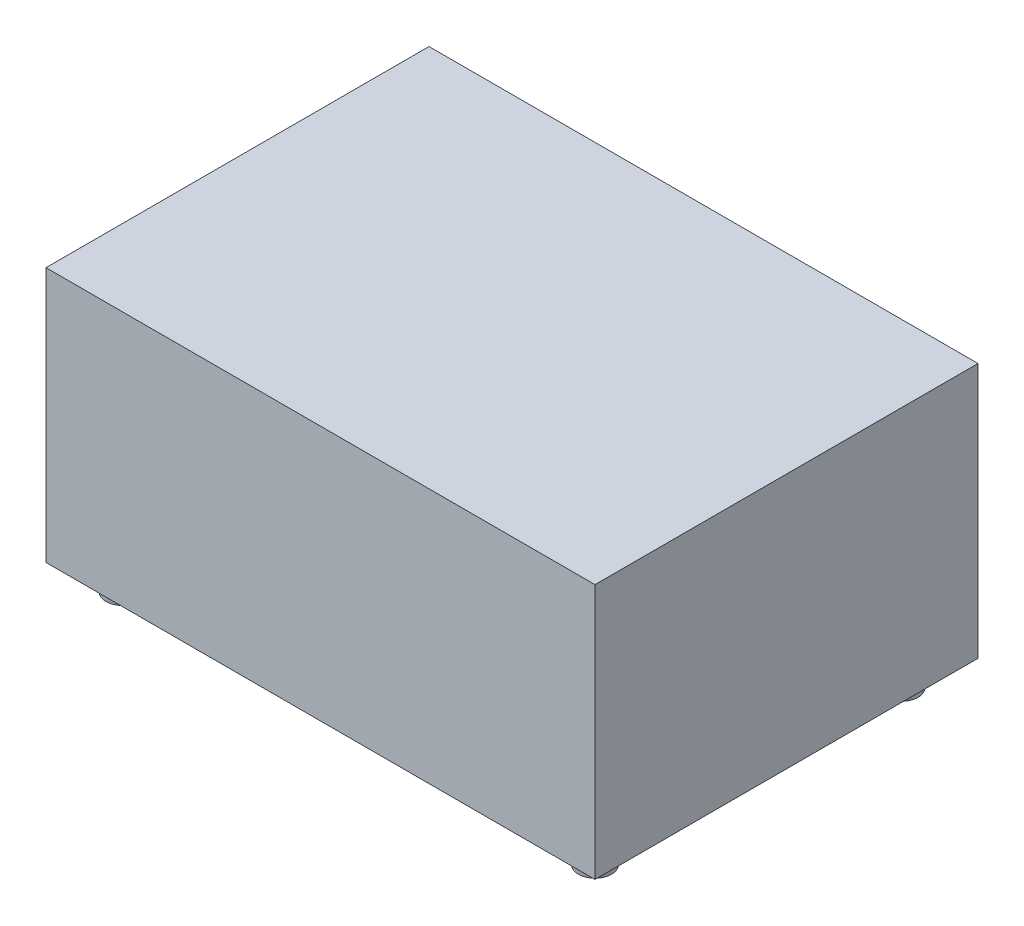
ISO-10303-21;
HEADER;
FILE_DESCRIPTION(('STEP AP214'),'2;1');
FILE_NAME('part.step','',(''),(''),'','','');
FILE_SCHEMA(('AUTOMOTIVE_DESIGN { 1 0 10303 214 1 1 1 1 }'));
ENDSEC;
DATA;
#1=APPLICATION_CONTEXT('core data for automotive mechanical design processes');
#2=APPLICATION_PROTOCOL_DEFINITION('international standard','automotive_design',2000,#1);
#3=PRODUCT_CONTEXT('',#1,'mechanical');
#4=PRODUCT('Part','Part','',(#3));
#5=PRODUCT_RELATED_PRODUCT_CATEGORY('part','',(#4));
#6=PRODUCT_DEFINITION_FORMATION('','',#4);
#7=PRODUCT_DEFINITION_CONTEXT('part definition',#1,'design');
#8=PRODUCT_DEFINITION('design','',#6,#7);
#9=PRODUCT_DEFINITION_SHAPE('','',#8);
#10=(LENGTH_UNIT() NAMED_UNIT(*) SI_UNIT(.MILLI.,.METRE.));
#11=(NAMED_UNIT(*) PLANE_ANGLE_UNIT() SI_UNIT($,.RADIAN.));
#12=(NAMED_UNIT(*) SI_UNIT($,.STERADIAN.) SOLID_ANGLE_UNIT());
#13=UNCERTAINTY_MEASURE_WITH_UNIT(LENGTH_MEASURE(1.E-05),#10,'distance_accuracy_value','');
#14=(GEOMETRIC_REPRESENTATION_CONTEXT(3) GLOBAL_UNCERTAINTY_ASSIGNED_CONTEXT((#13)) GLOBAL_UNIT_ASSIGNED_CONTEXT((#10,
#11,#12)) REPRESENTATION_CONTEXT('',''));
#15=CARTESIAN_POINT('',(0.,0.,0.));
#16=DIRECTION('',(0.,0.,1.));
#17=DIRECTION('',(1.,0.,0.));
#18=AXIS2_PLACEMENT_3D('',#15,#16,#17);
#19=CARTESIAN_POINT('',(0.,-100.,150.));
#20=DIRECTION('',(0.,1.,0.));
#21=DIRECTION('',(0.,0.,1.));
#22=AXIS2_PLACEMENT_3D('',#19,#20,#21);
#23=PLANE('',#22);
#24=CARTESIAN_POINT('',(200.,-100.,15.));
#25=DIRECTION('',(0.,1.,0.));
#26=DIRECTION('',(0.,0.,1.));
#27=AXIS2_PLACEMENT_3D('',#24,#25,#26);
#28=CIRCLE('',#27,7.50000000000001);
#29=CARTESIAN_POINT('',(200.,-100.,22.5));
#30=VERTEX_POINT('',#29);
#31=EDGE_CURVE('E116',#30,#30,#28,.F.);
#32=ORIENTED_EDGE('',*,*,#31,.F.);
#33=EDGE_LOOP('',(#32));
#34=FACE_BOUND('',#33,.T.);
#35=CARTESIAN_POINT('',(15.,-100.,15.));
#36=DIRECTION('',(0.,1.,0.));
#37=DIRECTION('',(0.,0.,1.));
#38=AXIS2_PLACEMENT_3D('',#35,#36,#37);
#39=CIRCLE('',#38,7.5);
#40=CARTESIAN_POINT('',(15.,-100.,22.5));
#41=VERTEX_POINT('',#40);
#42=EDGE_CURVE('E110',#41,#41,#39,.F.);
#43=ORIENTED_EDGE('',*,*,#42,.F.);
#44=EDGE_LOOP('',(#43));
#45=FACE_BOUND('',#44,.T.);
#46=DIRECTION('',(1.,0.,0.));
#47=VECTOR('',#46,1.);
#48=CARTESIAN_POINT('',(0.,-100.,0.));
#49=LINE('',#48,#47);
#50=CARTESIAN_POINT('',(0.,-100.,0.));
#51=VERTEX_POINT('',#50);
#52=CARTESIAN_POINT('',(215.,-100.,0.));
#53=VERTEX_POINT('',#52);
#54=EDGE_CURVE('E91',#51,#53,#49,.T.);
#55=ORIENTED_EDGE('',*,*,#54,.T.);
#56=DIRECTION('',(0.,0.,-1.));
#57=VECTOR('',#56,1.);
#58=CARTESIAN_POINT('',(215.,-100.,150.));
#59=LINE('',#58,#57);
#60=CARTESIAN_POINT('',(215.,-100.,150.));
#61=VERTEX_POINT('',#60);
#62=EDGE_CURVE('E89',#61,#53,#59,.T.);
#63=ORIENTED_EDGE('',*,*,#62,.F.);
#64=DIRECTION('',(1.,0.,0.));
#65=VECTOR('',#64,1.);
#66=CARTESIAN_POINT('',(0.,-100.,150.));
#67=LINE('',#66,#65);
#68=CARTESIAN_POINT('',(0.,-100.,150.));
#69=VERTEX_POINT('',#68);
#70=EDGE_CURVE('E81',#69,#61,#67,.T.);
#71=ORIENTED_EDGE('',*,*,#70,.F.);
#72=DIRECTION('',(0.,0.,-1.));
#73=VECTOR('',#72,1.);
#74=CARTESIAN_POINT('',(0.,-100.,150.));
#75=LINE('',#74,#73);
#76=EDGE_CURVE('E92',#69,#51,#75,.T.);
#77=ORIENTED_EDGE('',*,*,#76,.T.);
#78=EDGE_LOOP('',(#55,#63,#71,#77));
#79=FACE_BOUND('',#78,.T.);
#80=CARTESIAN_POINT('',(15.,-100.,135.));
#81=DIRECTION('',(0.,1.,0.));
#82=DIRECTION('',(0.,0.,1.));
#83=AXIS2_PLACEMENT_3D('',#80,#81,#82);
#84=CIRCLE('',#83,7.5);
#85=CARTESIAN_POINT('',(15.,-100.,142.5));
#86=VERTEX_POINT('',#85);
#87=EDGE_CURVE('E113',#86,#86,#84,.F.);
#88=ORIENTED_EDGE('',*,*,#87,.F.);
#89=EDGE_LOOP('',(#88));
#90=FACE_BOUND('',#89,.T.);
#91=CARTESIAN_POINT('',(200.,-100.,135.));
#92=DIRECTION('',(0.,1.,0.));
#93=DIRECTION('',(0.,0.,1.));
#94=AXIS2_PLACEMENT_3D('',#91,#92,#93);
#95=CIRCLE('',#94,7.50000000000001);
#96=CARTESIAN_POINT('',(200.,-100.,142.5));
#97=VERTEX_POINT('',#96);
#98=EDGE_CURVE('E119',#97,#97,#95,.F.);
#99=ORIENTED_EDGE('',*,*,#98,.F.);
#100=EDGE_LOOP('',(#99));
#101=FACE_BOUND('',#100,.T.);
#102=ADVANCED_FACE('F33',(#34,#45,#79,#90,#101),#23,.F.);
#103=CARTESIAN_POINT('',(0.,0.,150.));
#104=DIRECTION('',(1.,0.,0.));
#105=DIRECTION('',(0.,1.,0.));
#106=AXIS2_PLACEMENT_3D('',#103,#104,#105);
#107=PLANE('',#106);
#108=DIRECTION('',(0.,-1.,0.));
#109=VECTOR('',#108,1.);
#110=CARTESIAN_POINT('',(0.,0.,0.));
#111=LINE('',#110,#109);
#112=CARTESIAN_POINT('',(0.,0.,0.));
#113=VERTEX_POINT('',#112);
#114=EDGE_CURVE('E101',#113,#51,#111,.T.);
#115=ORIENTED_EDGE('',*,*,#114,.T.);
#116=ORIENTED_EDGE('',*,*,#76,.F.);
#117=DIRECTION('',(0.,-1.,0.));
#118=VECTOR('',#117,1.);
#119=CARTESIAN_POINT('',(0.,0.,150.));
#120=LINE('',#119,#118);
#121=CARTESIAN_POINT('',(0.,0.,150.));
#122=VERTEX_POINT('',#121);
#123=EDGE_CURVE('E86',#122,#69,#120,.T.);
#124=ORIENTED_EDGE('',*,*,#123,.F.);
#125=DIRECTION('',(0.,0.,-1.));
#126=VECTOR('',#125,1.);
#127=CARTESIAN_POINT('',(0.,0.,150.));
#128=LINE('',#127,#126);
#129=EDGE_CURVE('E97',#122,#113,#128,.T.);
#130=ORIENTED_EDGE('',*,*,#129,.T.);
#131=EDGE_LOOP('',(#115,#116,#124,#130));
#132=FACE_BOUND('',#131,.T.);
#133=ADVANCED_FACE('F145',(#132),#107,.F.);
#134=CARTESIAN_POINT('',(215.,0.,150.));
#135=DIRECTION('',(-1.,0.,0.));
#136=DIRECTION('',(0.,0.,1.));
#137=AXIS2_PLACEMENT_3D('',#134,#135,#136);
#138=PLANE('',#137);
#139=DIRECTION('',(0.,1.,0.));
#140=VECTOR('',#139,1.);
#141=CARTESIAN_POINT('',(215.,0.,0.));
#142=LINE('',#141,#140);
#143=CARTESIAN_POINT('',(215.,0.,0.));
#144=VERTEX_POINT('',#143);
#145=EDGE_CURVE('E67',#53,#144,#142,.T.);
#146=ORIENTED_EDGE('',*,*,#145,.T.);
#147=DIRECTION('',(0.,0.,-1.));
#148=VECTOR('',#147,1.);
#149=CARTESIAN_POINT('',(215.,0.,150.));
#150=LINE('',#149,#148);
#151=CARTESIAN_POINT('',(215.,0.,150.));
#152=VERTEX_POINT('',#151);
#153=EDGE_CURVE('E93',#152,#144,#150,.T.);
#154=ORIENTED_EDGE('',*,*,#153,.F.);
#155=DIRECTION('',(0.,1.,0.));
#156=VECTOR('',#155,1.);
#157=CARTESIAN_POINT('',(215.,0.,150.));
#158=LINE('',#157,#156);
#159=EDGE_CURVE('E84',#61,#152,#158,.T.);
#160=ORIENTED_EDGE('',*,*,#159,.F.);
#161=ORIENTED_EDGE('',*,*,#62,.T.);
#162=EDGE_LOOP('',(#146,#154,#160,#161));
#163=FACE_BOUND('',#162,.T.);
#164=ADVANCED_FACE('F95',(#163),#138,.F.);
#165=CARTESIAN_POINT('',(0.,0.,150.));
#166=DIRECTION('',(0.,-1.,0.));
#167=DIRECTION('',(0.,0.,-1.));
#168=AXIS2_PLACEMENT_3D('',#165,#166,#167);
#169=PLANE('',#168);
#170=DIRECTION('',(-1.,0.,0.));
#171=VECTOR('',#170,1.);
#172=CARTESIAN_POINT('',(0.,0.,0.));
#173=LINE('',#172,#171);
#174=EDGE_CURVE('E73',#144,#113,#173,.T.);
#175=ORIENTED_EDGE('',*,*,#174,.T.);
#176=ORIENTED_EDGE('',*,*,#129,.F.);
#177=DIRECTION('',(-1.,0.,0.));
#178=VECTOR('',#177,1.);
#179=CARTESIAN_POINT('',(0.,0.,150.));
#180=LINE('',#179,#178);
#181=EDGE_CURVE('E50',#152,#122,#180,.T.);
#182=ORIENTED_EDGE('',*,*,#181,.F.);
#183=ORIENTED_EDGE('',*,*,#153,.T.);
#184=EDGE_LOOP('',(#175,#176,#182,#183));
#185=FACE_BOUND('',#184,.T.);
#186=ADVANCED_FACE('F186',(#185),#169,.F.);
#187=CARTESIAN_POINT('',(0.,-100.,150.));
#188=DIRECTION('',(0.,0.,1.));
#189=DIRECTION('',(1.,0.,0.));
#190=AXIS2_PLACEMENT_3D('',#187,#188,#189);
#191=PLANE('',#190);
#192=ORIENTED_EDGE('',*,*,#123,.T.);
#193=ORIENTED_EDGE('',*,*,#70,.T.);
#194=ORIENTED_EDGE('',*,*,#159,.T.);
#195=ORIENTED_EDGE('',*,*,#181,.T.);
#196=EDGE_LOOP('',(#192,#193,#194,#195));
#197=FACE_BOUND('',#196,.T.);
#198=ADVANCED_FACE('F82',(#197),#191,.T.);
#199=CARTESIAN_POINT('',(0.,-100.,0.));
#200=DIRECTION('',(0.,0.,1.));
#201=DIRECTION('',(1.,0.,0.));
#202=AXIS2_PLACEMENT_3D('',#199,#200,#201);
#203=PLANE('',#202);
#204=ORIENTED_EDGE('',*,*,#114,.F.);
#205=ORIENTED_EDGE('',*,*,#174,.F.);
#206=ORIENTED_EDGE('',*,*,#145,.F.);
#207=ORIENTED_EDGE('',*,*,#54,.F.);
#208=EDGE_LOOP('',(#204,#205,#206,#207));
#209=FACE_BOUND('',#208,.T.);
#210=ADVANCED_FACE('F182',(#209),#203,.F.);
#211=CARTESIAN_POINT('',(15.,-110.,15.));
#212=DIRECTION('',(0.,-1.,0.));
#213=DIRECTION('',(0.,0.,-1.));
#214=AXIS2_PLACEMENT_3D('',#211,#212,#213);
#215=PLANE('',#214);
#216=CARTESIAN_POINT('',(15.,-110.,15.));
#217=DIRECTION('',(0.,-1.,0.));
#218=DIRECTION('',(0.,0.,-1.));
#219=AXIS2_PLACEMENT_3D('',#216,#217,#218);
#220=CIRCLE('',#219,6.49999999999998);
#221=CARTESIAN_POINT('',(15.,-110.,8.50000000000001));
#222=VERTEX_POINT('',#221);
#223=EDGE_CURVE('E11',#222,#222,#220,.T.);
#224=ORIENTED_EDGE('',*,*,#223,.T.);
#225=EDGE_LOOP('',(#224));
#226=FACE_BOUND('',#225,.T.);
#227=ADVANCED_FACE('F178',(#226),#215,.T.);
#228=CARTESIAN_POINT('',(15.,-110.,135.));
#229=DIRECTION('',(0.,-1.,0.));
#230=DIRECTION('',(0.,0.,-1.));
#231=AXIS2_PLACEMENT_3D('',#228,#229,#230);
#232=PLANE('',#231);
#233=CARTESIAN_POINT('',(15.,-110.,135.));
#234=DIRECTION('',(0.,-1.,0.));
#235=DIRECTION('',(0.,0.,-1.));
#236=AXIS2_PLACEMENT_3D('',#233,#234,#235);
#237=CIRCLE('',#236,6.50000000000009);
#238=CARTESIAN_POINT('',(15.,-110.,141.5));
#239=VERTEX_POINT('',#238);
#240=EDGE_CURVE('E125',#239,#239,#237,.T.);
#241=ORIENTED_EDGE('',*,*,#240,.T.);
#242=EDGE_LOOP('',(#241));
#243=FACE_BOUND('',#242,.T.);
#244=ADVANCED_FACE('F173',(#243),#232,.T.);
#245=CARTESIAN_POINT('',(200.,-110.,15.));
#246=DIRECTION('',(0.,-1.,0.));
#247=DIRECTION('',(0.,0.,-1.));
#248=AXIS2_PLACEMENT_3D('',#245,#246,#247);
#249=PLANE('',#248);
#250=CARTESIAN_POINT('',(200.,-110.,15.));
#251=DIRECTION('',(0.,-1.,0.));
#252=DIRECTION('',(0.,0.,-1.));
#253=AXIS2_PLACEMENT_3D('',#250,#251,#252);
#254=CIRCLE('',#253,6.49999999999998);
#255=CARTESIAN_POINT('',(200.,-110.,8.50000000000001));
#256=VERTEX_POINT('',#255);
#257=EDGE_CURVE('E42',#256,#256,#254,.T.);
#258=ORIENTED_EDGE('',*,*,#257,.T.);
#259=EDGE_LOOP('',(#258));
#260=FACE_BOUND('',#259,.T.);
#261=ADVANCED_FACE('F130',(#260),#249,.T.);
#262=CARTESIAN_POINT('',(200.,-110.,135.));
#263=DIRECTION('',(0.,-1.,0.));
#264=DIRECTION('',(0.,0.,-1.));
#265=AXIS2_PLACEMENT_3D('',#262,#263,#264);
#266=PLANE('',#265);
#267=CARTESIAN_POINT('',(200.,-110.,135.));
#268=DIRECTION('',(0.,-1.,0.));
#269=DIRECTION('',(0.,0.,-1.));
#270=AXIS2_PLACEMENT_3D('',#267,#268,#269);
#271=CIRCLE('',#270,6.50000000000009);
#272=CARTESIAN_POINT('',(200.,-110.,128.5));
#273=VERTEX_POINT('',#272);
#274=EDGE_CURVE('E122',#273,#273,#271,.T.);
#275=ORIENTED_EDGE('',*,*,#274,.T.);
#276=EDGE_LOOP('',(#275));
#277=FACE_BOUND('',#276,.T.);
#278=ADVANCED_FACE('F159',(#277),#266,.T.);
#279=CARTESIAN_POINT('',(200.,-110.,135.));
#280=DIRECTION('',(0.,1.,0.));
#281=DIRECTION('',(0.,0.,1.));
#282=AXIS2_PLACEMENT_3D('',#279,#280,#281);
#283=CONICAL_SURFACE('',#282,6.50000000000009,0.0996686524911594);
#284=ORIENTED_EDGE('',*,*,#98,.T.);
#285=EDGE_LOOP('',(#284));
#286=FACE_BOUND('',#285,.T.);
#287=ORIENTED_EDGE('',*,*,#274,.F.);
#288=EDGE_LOOP('',(#287));
#289=FACE_BOUND('',#288,.T.);
#290=ADVANCED_FACE('F141',(#286,#289),#283,.T.);
#291=CARTESIAN_POINT('',(15.,-110.,135.));
#292=DIRECTION('',(0.,1.,0.));
#293=DIRECTION('',(0.,0.,1.));
#294=AXIS2_PLACEMENT_3D('',#291,#292,#293);
#295=CONICAL_SURFACE('',#294,6.50000000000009,0.0996686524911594);
#296=CARTESIAN_POINT('',(15.,-100.,142.5));
#297=CARTESIAN_POINT('',(15.,-100.104166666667,142.489583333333));
#298=CARTESIAN_POINT('',(15.,-100.208333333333,142.479166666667));
#299=CARTESIAN_POINT('',(15.,-100.416666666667,142.458333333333));
#300=CARTESIAN_POINT('',(15.,-100.520833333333,142.447916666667));
#301=CARTESIAN_POINT('',(15.,-100.729166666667,142.427083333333));
#302=CARTESIAN_POINT('',(15.,-100.833333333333,142.416666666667));
#303=CARTESIAN_POINT('',(15.,-101.041666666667,142.395833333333));
#304=CARTESIAN_POINT('',(15.,-101.145833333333,142.385416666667));
#305=CARTESIAN_POINT('',(15.,-101.354166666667,142.364583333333));
#306=CARTESIAN_POINT('',(15.,-101.458333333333,142.354166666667));
#307=CARTESIAN_POINT('',(15.,-101.666666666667,142.333333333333));
#308=CARTESIAN_POINT('',(15.,-101.770833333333,142.322916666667));
#309=CARTESIAN_POINT('',(15.,-101.979166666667,142.302083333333));
#310=CARTESIAN_POINT('',(15.,-102.083333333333,142.291666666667));
#311=CARTESIAN_POINT('',(15.,-102.291666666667,142.270833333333));
#312=CARTESIAN_POINT('',(15.,-102.395833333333,142.260416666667));
#313=CARTESIAN_POINT('',(15.,-102.604166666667,142.239583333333));
#314=CARTESIAN_POINT('',(15.,-102.708333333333,142.229166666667));
#315=CARTESIAN_POINT('',(15.,-102.916666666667,142.208333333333));
#316=CARTESIAN_POINT('',(15.,-103.020833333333,142.197916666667));
#317=CARTESIAN_POINT('',(15.,-103.229166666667,142.177083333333));
#318=CARTESIAN_POINT('',(15.,-103.333333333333,142.166666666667));
#319=CARTESIAN_POINT('',(15.,-103.541666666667,142.145833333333));
#320=CARTESIAN_POINT('',(15.,-103.645833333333,142.135416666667));
#321=CARTESIAN_POINT('',(15.,-103.854166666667,142.114583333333));
#322=CARTESIAN_POINT('',(15.,-103.958333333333,142.104166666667));
#323=CARTESIAN_POINT('',(15.,-104.166666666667,142.083333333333));
#324=CARTESIAN_POINT('',(15.,-104.270833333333,142.072916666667));
#325=CARTESIAN_POINT('',(15.,-104.479166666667,142.052083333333));
#326=CARTESIAN_POINT('',(15.,-104.583333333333,142.041666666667));
#327=CARTESIAN_POINT('',(15.,-104.791666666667,142.020833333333));
#328=CARTESIAN_POINT('',(15.,-104.895833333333,142.010416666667));
#329=CARTESIAN_POINT('',(15.,-105.104166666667,141.989583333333));
#330=CARTESIAN_POINT('',(15.,-105.208333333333,141.979166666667));
#331=CARTESIAN_POINT('',(15.,-105.416666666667,141.958333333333));
#332=CARTESIAN_POINT('',(15.,-105.520833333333,141.947916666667));
#333=CARTESIAN_POINT('',(15.,-105.729166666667,141.927083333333));
#334=CARTESIAN_POINT('',(15.,-105.833333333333,141.916666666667));
#335=CARTESIAN_POINT('',(15.,-106.041666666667,141.895833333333));
#336=CARTESIAN_POINT('',(15.,-106.145833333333,141.885416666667));
#337=CARTESIAN_POINT('',(15.,-106.354166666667,141.864583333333));
#338=CARTESIAN_POINT('',(15.,-106.458333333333,141.854166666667));
#339=CARTESIAN_POINT('',(15.,-106.666666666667,141.833333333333));
#340=CARTESIAN_POINT('',(15.,-106.770833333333,141.822916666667));
#341=CARTESIAN_POINT('',(15.,-106.979166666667,141.802083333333));
#342=CARTESIAN_POINT('',(15.,-107.083333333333,141.791666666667));
#343=CARTESIAN_POINT('',(15.,-107.291666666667,141.770833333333));
#344=CARTESIAN_POINT('',(15.,-107.395833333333,141.760416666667));
#345=CARTESIAN_POINT('',(15.,-107.604166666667,141.739583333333));
#346=CARTESIAN_POINT('',(15.,-107.708333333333,141.729166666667));
#347=CARTESIAN_POINT('',(15.,-107.916666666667,141.708333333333));
#348=CARTESIAN_POINT('',(15.,-108.020833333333,141.697916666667));
#349=CARTESIAN_POINT('',(15.,-108.229166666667,141.677083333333));
#350=CARTESIAN_POINT('',(15.,-108.333333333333,141.666666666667));
#351=CARTESIAN_POINT('',(15.,-108.541666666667,141.645833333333));
#352=CARTESIAN_POINT('',(15.,-108.645833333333,141.635416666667));
#353=CARTESIAN_POINT('',(15.,-108.854166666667,141.614583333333));
#354=CARTESIAN_POINT('',(15.,-108.958333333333,141.604166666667));
#355=CARTESIAN_POINT('',(15.,-109.166666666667,141.583333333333));
#356=CARTESIAN_POINT('',(15.,-109.270833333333,141.572916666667));
#357=CARTESIAN_POINT('',(15.,-109.479166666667,141.552083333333));
#358=CARTESIAN_POINT('',(15.,-109.583333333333,141.541666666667));
#359=CARTESIAN_POINT('',(15.,-109.791666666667,141.520833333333));
#360=CARTESIAN_POINT('',(15.,-109.895833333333,141.510416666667));
#361=CARTESIAN_POINT('',(15.,-110.,141.5));
#362=B_SPLINE_CURVE_WITH_KNOTS('',3,(#296,#297,#298,#299,#300,#301,#302,#303,#304,#305,#306,
#307,#308,#309,#310,#311,#312,#313,#314,#315,#316,#317,#318,#319,#320,#321,#322,#323,#324,#325,
#326,#327,#328,#329,#330,#331,#332,#333,#334,#335,#336,#337,#338,#339,#340,#341,#342,#343,#344,
#345,#346,#347,#348,#349,#350,#351,#352,#353,#354,#355,#356,#357,#358,#359,#360,#361),
.UNSPECIFIED.,.F.,.F.,(4,2,2,2,2,2,2,2,2,2,2,2,2,2,2,2,2,2,2,2,2,2,2,2,2,2,2,2,2,2,2,2,4),(0.,
0.314058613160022,0.628117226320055,0.942175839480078,1.2562344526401,1.57029306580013,
1.88435167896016,2.19841029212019,2.51246890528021,2.82652751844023,3.14058613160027,
3.45464474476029,3.76870335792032,4.08276197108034,4.39682058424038,4.7108791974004,
5.02493781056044,5.33899642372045,5.65305503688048,5.96711365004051,6.28117226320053,
6.59523087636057,6.90928948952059,7.22334810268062,7.53740671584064,7.85146532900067,
8.1655239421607,8.47958255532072,8.79364116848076,9.10769978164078,9.42175839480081,
9.73581700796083,10.0498756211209),.UNSPECIFIED.);
#363=EDGE_CURVE('BSEAM134',#86,#239,#362,.T.);
#364=ORIENTED_EDGE('',*,*,#87,.T.);
#365=ORIENTED_EDGE('',*,*,#240,.F.);
#366=ORIENTED_EDGE('',*,*,#363,.T.);
#367=ORIENTED_EDGE('',*,*,#363,.F.);
#368=EDGE_LOOP('',(#364,#366,#365,#367));
#369=FACE_BOUND('',#368,.T.);
#370=ADVANCED_FACE('F134',(#369),#295,.T.);
#371=CARTESIAN_POINT('',(200.,-110.,15.));
#372=DIRECTION('',(0.,1.,0.));
#373=DIRECTION('',(0.,0.,1.));
#374=AXIS2_PLACEMENT_3D('',#371,#372,#373);
#375=CONICAL_SURFACE('',#374,6.49999999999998,0.0996686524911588);
#376=ORIENTED_EDGE('',*,*,#31,.T.);
#377=EDGE_LOOP('',(#376));
#378=FACE_BOUND('',#377,.T.);
#379=ORIENTED_EDGE('',*,*,#257,.F.);
#380=EDGE_LOOP('',(#379));
#381=FACE_BOUND('',#380,.T.);
#382=ADVANCED_FACE('F132',(#378,#381),#375,.T.);
#383=CARTESIAN_POINT('',(15.,-110.,15.));
#384=DIRECTION('',(0.,1.,0.));
#385=DIRECTION('',(0.,0.,1.));
#386=AXIS2_PLACEMENT_3D('',#383,#384,#385);
#387=CONICAL_SURFACE('',#386,6.49999999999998,0.0996686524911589);
#388=ORIENTED_EDGE('',*,*,#42,.T.);
#389=EDGE_LOOP('',(#388));
#390=FACE_BOUND('',#389,.T.);
#391=ORIENTED_EDGE('',*,*,#223,.F.);
#392=EDGE_LOOP('',(#391));
#393=FACE_BOUND('',#392,.T.);
#394=ADVANCED_FACE('F35',(#390,#393),#387,.T.);
#395=CLOSED_SHELL('',(#102,#133,#164,#186,#198,#210,#227,#244,#261,#278,#290,#370,#382,#394));
#396=MANIFOLD_SOLID_BREP('B2',#395);
#397=ADVANCED_BREP_SHAPE_REPRESENTATION('',(#18,#396),#14);
#398=SHAPE_DEFINITION_REPRESENTATION(#9,#397);
ENDSEC;
END-ISO-10303-21;
